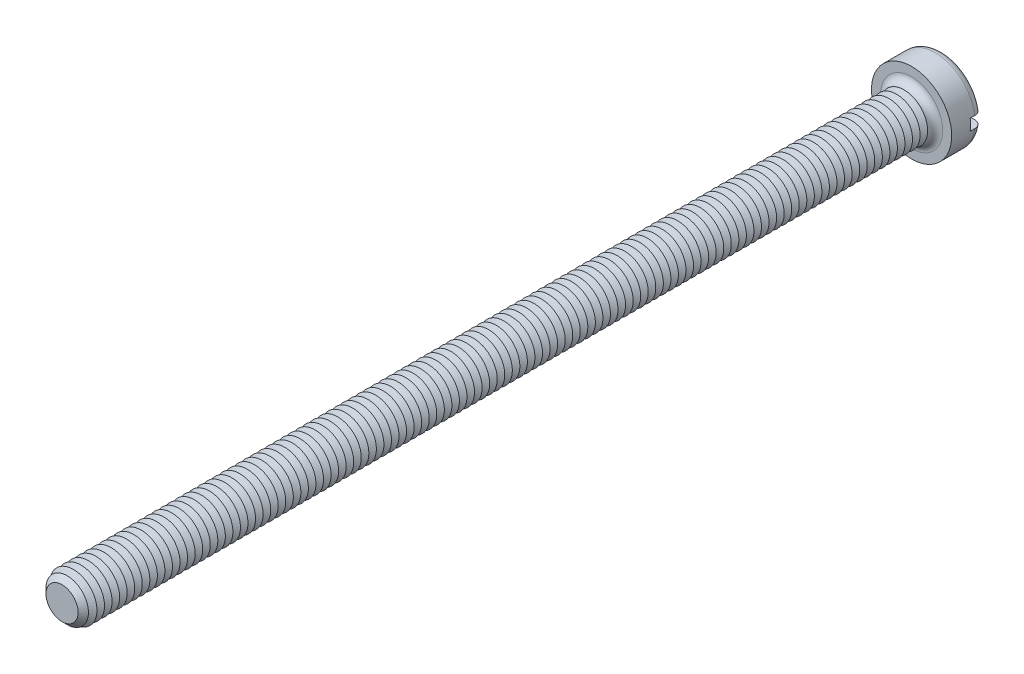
from build123d import *

# Parameters (mm, degrees)
SKETCH3_R           = 4.25
BOSS_EXTRUDE2_DEPTH = 3.3
SKETCH4_R           = 2.5
BOSS_EXTRUDE3_DEPTH = 90
FILLET1_R           = 0.8
CHAMFER1_SIZE       = 0.8
LPATTERN1_COUNT     = 111
LPATTERN1_PITCH     = 0.8
SKETCH8_W           = 8.5
SKETCH8_H           = 1.2
CUT_EXTRUDE1_DEPTH  = 1.3


with BuildPart() as part:
    # Sketch3 → Boss-Extrude2 (new body)
    with BuildSketch(Plane.XY):
        Circle(SKETCH3_R)
    extrude(amount=-BOSS_EXTRUDE2_DEPTH)

    # Sketch4 → Boss-Extrude3 (add)
    with BuildSketch(Plane.XY):
        with Locations(Location((0, 0, 0), (0, 0, 180))):
            Circle(SKETCH4_R)
    extrude(amount=BOSS_EXTRUDE3_DEPTH)

    # Fillet1
    fillet1_edges = [part.edges().sort_by_distance(p)[0] for p in [
        (-4.25, 0, -3.3),
        (2.5, 0, 0),
    ]]
    fillet(fillet1_edges, radius=FILLET1_R)

    # Chamfer1
    chamfer1_edges = [part.edges().sort_by_distance(p)[0] for p in [
        (2.5, 0, 90),
    ]]
    chamfer(chamfer1_edges, length=CHAMFER1_SIZE)

    # Sketch6 → Cut-Revolve1 (revolve, cut)
    with BuildSketch(Plane(origin=(0, 0, 0), x_dir=(0, 0, -1), z_dir=(1, 0, 0)), mode=Mode.PRIVATE) as cut_revolve1_sk:
        Polygon((-0.8, 2.5), (-1.2, 1.807179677), (-1.6, 2.5), align=None)
    cut_revolve1 = revolve(cut_revolve1_sk.sketch.rotate(Axis((0, 0, -1.694361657), (0, 0, 1)), 90), axis=Axis((0, 0, -1.694361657), (0, 0, 1)), mode=Mode.SUBTRACT)

    # LPattern1: Cut-Revolve1 ×111
    with Locations(*[(0, 0, i * LPATTERN1_PITCH) for i in range(1, LPATTERN1_COUNT)]):
        add(cut_revolve1, mode=Mode.SUBTRACT)

    # Sketch8 → Cut-Extrude1 (cut)
    with BuildSketch(Plane(origin=(0, 0, -3.3), x_dir=(-1, 0, 0), z_dir=(0, 0, -1))):
        Rectangle(SKETCH8_W, SKETCH8_H)
    extrude(amount=-CUT_EXTRUDE1_DEPTH, mode=Mode.SUBTRACT)


solid = part.part
